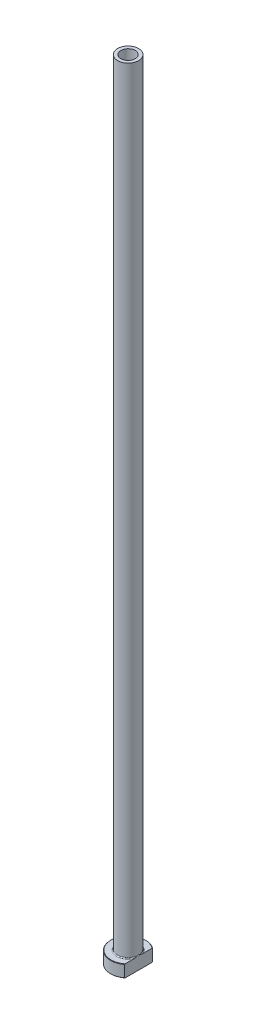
ISO-10303-21;
HEADER;
FILE_DESCRIPTION(('STEP AP214'),'2;1');
FILE_NAME('part.step','',(''),(''),'','','');
FILE_SCHEMA(('AUTOMOTIVE_DESIGN { 1 0 10303 214 1 1 1 1 }'));
ENDSEC;
DATA;
#1=APPLICATION_CONTEXT('core data for automotive mechanical design processes');
#2=APPLICATION_PROTOCOL_DEFINITION('international standard','automotive_design',2000,#1);
#3=PRODUCT_CONTEXT('',#1,'mechanical');
#4=PRODUCT('Part','Part','',(#3));
#5=PRODUCT_RELATED_PRODUCT_CATEGORY('part','',(#4));
#6=PRODUCT_DEFINITION_FORMATION('','',#4);
#7=PRODUCT_DEFINITION_CONTEXT('part definition',#1,'design');
#8=PRODUCT_DEFINITION('design','',#6,#7);
#9=PRODUCT_DEFINITION_SHAPE('','',#8);
#10=(LENGTH_UNIT() NAMED_UNIT(*) SI_UNIT(.MILLI.,.METRE.));
#11=(NAMED_UNIT(*) PLANE_ANGLE_UNIT() SI_UNIT($,.RADIAN.));
#12=(NAMED_UNIT(*) SI_UNIT($,.STERADIAN.) SOLID_ANGLE_UNIT());
#13=UNCERTAINTY_MEASURE_WITH_UNIT(LENGTH_MEASURE(1.E-05),#10,'distance_accuracy_value','');
#14=(GEOMETRIC_REPRESENTATION_CONTEXT(3) GLOBAL_UNCERTAINTY_ASSIGNED_CONTEXT((#13)) GLOBAL_UNIT_ASSIGNED_CONTEXT((#10,
#11,#12)) REPRESENTATION_CONTEXT('',''));
#15=CARTESIAN_POINT('',(0.,0.,0.));
#16=DIRECTION('',(0.,0.,1.));
#17=DIRECTION('',(1.,0.,0.));
#18=AXIS2_PLACEMENT_3D('',#15,#16,#17);
#19=CARTESIAN_POINT('',(0.,92.1876809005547,0.));
#20=DIRECTION('',(0.,1.,0.));
#21=DIRECTION('',(0.,0.,1.));
#22=AXIS2_PLACEMENT_3D('',#19,#20,#21);
#23=CYLINDRICAL_SURFACE('',#22,4.10000000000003);
#24=CARTESIAN_POINT('',(0.,450.,0.));
#25=DIRECTION('',(0.,1.,0.));
#26=DIRECTION('',(0.,0.,1.));
#27=AXIS2_PLACEMENT_3D('',#24,#25,#26);
#28=CIRCLE('',#27,4.10000000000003);
#29=CARTESIAN_POINT('',(0.,450.,4.10000000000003));
#30=VERTEX_POINT('',#29);
#31=EDGE_CURVE('E167',#30,#30,#28,.T.);
#32=ORIENTED_EDGE('',*,*,#31,.T.);
#33=EDGE_LOOP('',(#32));
#34=FACE_BOUND('',#33,.T.);
#35=CARTESIAN_POINT('',(0.,405.,0.));
#36=DIRECTION('',(0.,1.,0.));
#37=DIRECTION('',(0.,0.,1.));
#38=AXIS2_PLACEMENT_3D('',#35,#36,#37);
#39=CIRCLE('',#38,4.10000000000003);
#40=CARTESIAN_POINT('',(0.,405.,4.10000000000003));
#41=VERTEX_POINT('',#40);
#42=EDGE_CURVE('E170',#41,#41,#39,.T.);
#43=ORIENTED_EDGE('',*,*,#42,.F.);
#44=EDGE_LOOP('',(#43));
#45=FACE_BOUND('',#44,.T.);
#46=ADVANCED_FACE('F32',(#34,#45),#23,.F.);
#47=CARTESIAN_POINT('',(-4.10000000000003,450.,0.));
#48=DIRECTION('',(0.,1.,0.));
#49=DIRECTION('',(0.,0.,1.));
#50=AXIS2_PLACEMENT_3D('',#47,#48,#49);
#51=PLANE('',#50);
#52=CARTESIAN_POINT('',(0.,450.,0.));
#53=DIRECTION('',(0.,1.,0.));
#54=DIRECTION('',(0.,0.,1.));
#55=AXIS2_PLACEMENT_3D('',#52,#53,#54);
#56=CIRCLE('',#55,6.00000000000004);
#57=CARTESIAN_POINT('',(0.,450.,6.00000000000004));
#58=VERTEX_POINT('',#57);
#59=EDGE_CURVE('E174',#58,#58,#56,.T.);
#60=ORIENTED_EDGE('',*,*,#59,.T.);
#61=EDGE_LOOP('',(#60));
#62=FACE_BOUND('',#61,.T.);
#63=ORIENTED_EDGE('',*,*,#31,.F.);
#64=EDGE_LOOP('',(#63));
#65=FACE_BOUND('',#64,.T.);
#66=ADVANCED_FACE('F157',(#62,#65),#51,.T.);
#67=CARTESIAN_POINT('',(0.,92.1876809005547,0.));
#68=DIRECTION('',(0.,1.,0.));
#69=DIRECTION('',(0.,0.,1.));
#70=AXIS2_PLACEMENT_3D('',#67,#68,#69);
#71=CYLINDRICAL_SURFACE('',#70,6.00000000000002);
#72=CARTESIAN_POINT('',(0.,7.50000000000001,0.));
#73=DIRECTION('',(0.,1.,0.));
#74=DIRECTION('',(0.,0.,1.));
#75=AXIS2_PLACEMENT_3D('',#72,#73,#74);
#76=CIRCLE('',#75,6.00000000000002);
#77=CARTESIAN_POINT('',(6.00000000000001,7.50000000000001,0.));
#78=VERTEX_POINT('',#77);
#79=EDGE_CURVE('E180',#78,#78,#76,.T.);
#80=ORIENTED_EDGE('',*,*,#79,.T.);
#81=EDGE_LOOP('',(#80));
#82=FACE_BOUND('',#81,.T.);
#83=ORIENTED_EDGE('',*,*,#59,.F.);
#84=EDGE_LOOP('',(#83));
#85=FACE_BOUND('',#84,.T.);
#86=ADVANCED_FACE('F162',(#82,#85),#71,.T.);
#87=CARTESIAN_POINT('',(-5.99999999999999,7.,0.));
#88=DIRECTION('',(0.,1.,0.));
#89=DIRECTION('',(0.,0.,1.));
#90=AXIS2_PLACEMENT_3D('',#87,#88,#89);
#91=PLANE('',#90);
#92=DIRECTION('',(0.,0.,1.));
#93=VECTOR('',#92,1.);
#94=CARTESIAN_POINT('',(6.,7.,0.));
#95=LINE('',#94,#93);
#96=CARTESIAN_POINT('',(6.,7.,-7.74854825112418));
#97=VERTEX_POINT('',#96);
#98=CARTESIAN_POINT('',(6.,7.,-2.50000000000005));
#99=VERTEX_POINT('',#98);
#100=EDGE_CURVE('E54',#97,#99,#95,.T.);
#101=ORIENTED_EDGE('',*,*,#100,.F.);
#102=CARTESIAN_POINT('',(0.,7.,0.));
#103=DIRECTION('',(0.,1.,0.));
#104=DIRECTION('',(0.,0.,1.));
#105=AXIS2_PLACEMENT_3D('',#102,#103,#104);
#106=CIRCLE('',#105,9.79999999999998);
#107=CARTESIAN_POINT('',(5.99999999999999,7.,7.74854825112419));
#108=VERTEX_POINT('',#107);
#109=EDGE_CURVE('E186',#97,#108,#106,.T.);
#110=ORIENTED_EDGE('',*,*,#109,.T.);
#111=CARTESIAN_POINT('',(6.,7.,2.50000000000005));
#112=VERTEX_POINT('',#111);
#113=EDGE_CURVE('E134',#112,#108,#95,.T.);
#114=ORIENTED_EDGE('',*,*,#113,.F.);
#115=CARTESIAN_POINT('',(0.,7.,0.));
#116=DIRECTION('',(0.,1.,0.));
#117=DIRECTION('',(0.,0.,1.));
#118=AXIS2_PLACEMENT_3D('',#115,#116,#117);
#119=CIRCLE('',#118,6.50000000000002);
#120=EDGE_CURVE('E183',#112,#99,#119,.F.);
#121=ORIENTED_EDGE('',*,*,#120,.T.);
#122=EDGE_LOOP('',(#101,#110,#114,#121));
#123=FACE_BOUND('',#122,.T.);
#124=ADVANCED_FACE('F197',(#123),#91,.T.);
#125=CARTESIAN_POINT('',(0.,92.1876809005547,0.));
#126=DIRECTION('',(0.,1.,0.));
#127=DIRECTION('',(0.,0.,1.));
#128=AXIS2_PLACEMENT_3D('',#125,#126,#127);
#129=CYLINDRICAL_SURFACE('',#128,9.99999999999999);
#130=DIRECTION('',(0.,-1.,0.));
#131=VECTOR('',#130,1.);
#132=CARTESIAN_POINT('',(5.99999999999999,450.,7.99999999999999));
#133=LINE('',#132,#131);
#134=CARTESIAN_POINT('',(5.99999999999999,6.79999999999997,7.99999999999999));
#135=VERTEX_POINT('',#134);
#136=CARTESIAN_POINT('',(5.99999999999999,0.200000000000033,7.99999999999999));
#137=VERTEX_POINT('',#136);
#138=EDGE_CURVE('E82',#135,#137,#133,.T.);
#139=ORIENTED_EDGE('',*,*,#138,.F.);
#140=CARTESIAN_POINT('',(0.,6.79999999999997,0.));
#141=DIRECTION('',(0.,1.,0.));
#142=DIRECTION('',(0.,0.,1.));
#143=AXIS2_PLACEMENT_3D('',#140,#141,#142);
#144=CIRCLE('',#143,9.99999999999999);
#145=CARTESIAN_POINT('',(6.,6.79999999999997,-7.99999999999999));
#146=VERTEX_POINT('',#145);
#147=EDGE_CURVE('E95',#135,#146,#144,.F.);
#148=ORIENTED_EDGE('',*,*,#147,.T.);
#149=DIRECTION('',(0.,-1.,0.));
#150=VECTOR('',#149,1.);
#151=CARTESIAN_POINT('',(6.,450.,-7.99999999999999));
#152=LINE('',#151,#150);
#153=CARTESIAN_POINT('',(6.,0.200000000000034,-7.99999999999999));
#154=VERTEX_POINT('',#153);
#155=EDGE_CURVE('E192',#146,#154,#152,.T.);
#156=ORIENTED_EDGE('',*,*,#155,.T.);
#157=CARTESIAN_POINT('',(0.,0.200000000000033,0.));
#158=DIRECTION('',(0.,-1.,0.));
#159=DIRECTION('',(0.,0.,-1.));
#160=AXIS2_PLACEMENT_3D('',#157,#158,#159);
#161=CIRCLE('',#160,9.99999999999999);
#162=EDGE_CURVE('E98',#154,#137,#161,.F.);
#163=ORIENTED_EDGE('',*,*,#162,.T.);
#164=EDGE_LOOP('',(#139,#148,#156,#163));
#165=FACE_BOUND('',#164,.T.);
#166=ADVANCED_FACE('F190',(#165),#129,.T.);
#167=CARTESIAN_POINT('',(-9.99999999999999,0.,0.));
#168=DIRECTION('',(0.,-1.,0.));
#169=DIRECTION('',(0.,0.,-1.));
#170=AXIS2_PLACEMENT_3D('',#167,#168,#169);
#171=PLANE('',#170);
#172=CARTESIAN_POINT('',(0.,0.,0.));
#173=DIRECTION('',(0.,-1.,0.));
#174=DIRECTION('',(0.,0.,-1.));
#175=AXIS2_PLACEMENT_3D('',#172,#173,#174);
#176=CIRCLE('',#175,4.84999999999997);
#177=CARTESIAN_POINT('',(0.,0.,-4.84999999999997));
#178=VERTEX_POINT('',#177);
#179=EDGE_CURVE('E40',#178,#178,#176,.F.);
#180=ORIENTED_EDGE('',*,*,#179,.T.);
#181=EDGE_LOOP('',(#180));
#182=FACE_BOUND('',#181,.T.);
#183=DIRECTION('',(0.,0.,-1.));
#184=VECTOR('',#183,1.);
#185=CARTESIAN_POINT('',(5.99999999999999,0.,7.99999999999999));
#186=LINE('',#185,#184);
#187=CARTESIAN_POINT('',(5.99999999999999,0.,7.74854825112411));
#188=VERTEX_POINT('',#187);
#189=CARTESIAN_POINT('',(6.,0.,-7.74854825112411));
#190=VERTEX_POINT('',#189);
#191=EDGE_CURVE('E47',#188,#190,#186,.T.);
#192=ORIENTED_EDGE('',*,*,#191,.F.);
#193=CARTESIAN_POINT('',(0.,0.,0.));
#194=DIRECTION('',(0.,-1.,0.));
#195=DIRECTION('',(0.,0.,-1.));
#196=AXIS2_PLACEMENT_3D('',#193,#194,#195);
#197=CIRCLE('',#196,9.79999999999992);
#198=EDGE_CURVE('E92',#188,#190,#197,.T.);
#199=ORIENTED_EDGE('',*,*,#198,.T.);
#200=EDGE_LOOP('',(#192,#199));
#201=FACE_BOUND('',#200,.T.);
#202=ADVANCED_FACE('F91',(#182,#201),#171,.T.);
#203=CARTESIAN_POINT('',(0.,92.1876809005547,0.));
#204=DIRECTION('',(0.,1.,0.));
#205=DIRECTION('',(0.,0.,1.));
#206=AXIS2_PLACEMENT_3D('',#203,#204,#205);
#207=CYLINDRICAL_SURFACE('',#206,4.35000000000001);
#208=CARTESIAN_POINT('',(0.,0.499999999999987,0.));
#209=DIRECTION('',(0.,-1.,0.));
#210=DIRECTION('',(0.,0.,-1.));
#211=AXIS2_PLACEMENT_3D('',#208,#209,#210);
#212=CIRCLE('',#211,4.35000000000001);
#213=CARTESIAN_POINT('',(0.,0.499999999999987,-4.35000000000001));
#214=VERTEX_POINT('',#213);
#215=EDGE_CURVE('E11',#214,#214,#212,.T.);
#216=ORIENTED_EDGE('',*,*,#215,.T.);
#217=EDGE_LOOP('',(#216));
#218=FACE_BOUND('',#217,.T.);
#219=CARTESIAN_POINT('',(0.,393.,0.));
#220=DIRECTION('',(0.,1.,0.));
#221=DIRECTION('',(0.,0.,1.));
#222=AXIS2_PLACEMENT_3D('',#219,#220,#221);
#223=CIRCLE('',#222,4.35000000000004);
#224=CARTESIAN_POINT('',(0.,393.,4.35000000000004));
#225=VERTEX_POINT('',#224);
#226=EDGE_CURVE('E172',#225,#225,#223,.T.);
#227=ORIENTED_EDGE('',*,*,#226,.T.);
#228=EDGE_LOOP('',(#227));
#229=FACE_BOUND('',#228,.T.);
#230=ADVANCED_FACE('F215',(#218,#229),#207,.F.);
#231=CARTESIAN_POINT('',(0.,393.,0.));
#232=DIRECTION('',(0.,-1.,0.));
#233=DIRECTION('',(0.,0.,-1.));
#234=AXIS2_PLACEMENT_3D('',#231,#232,#233);
#235=CONICAL_SURFACE('',#234,4.35000000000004,0.0208303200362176);
#236=ORIENTED_EDGE('',*,*,#42,.T.);
#237=EDGE_LOOP('',(#236));
#238=FACE_BOUND('',#237,.T.);
#239=ORIENTED_EDGE('',*,*,#226,.F.);
#240=EDGE_LOOP('',(#239));
#241=FACE_BOUND('',#240,.T.);
#242=ADVANCED_FACE('F111',(#238,#241),#235,.F.);
#243=CARTESIAN_POINT('',(0.,7.50000000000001,0.));
#244=DIRECTION('',(0.,1.,0.));
#245=DIRECTION('',(0.,0.,1.));
#246=AXIS2_PLACEMENT_3D('',#243,#244,#245);
#247=TOROIDAL_SURFACE('',#246,6.50000000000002,0.5);
#248=ORIENTED_EDGE('',*,*,#120,.F.);
#249=CARTESIAN_POINT('',(6.00000000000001,7.50000000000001,0.));
#250=CARTESIAN_POINT('',(6.00000000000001,7.50000080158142,6.7058748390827E-11));
#251=CARTESIAN_POINT('',(6.00000000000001,7.50000160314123,2.62463026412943E-07));
#252=CARTESIAN_POINT('',(6.00000000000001,7.50000311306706,1.01907268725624E-06));
#253=CARTESIAN_POINT('',(6.00000000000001,7.50000381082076,1.52838026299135E-06));
#254=CARTESIAN_POINT('',(6.00000000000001,7.50000523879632,2.74467753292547E-06));
#255=CARTESIAN_POINT('',(6.00000000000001,7.50000595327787,3.47066892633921E-06));
#256=CARTESIAN_POINT('',(6.00000000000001,7.5000072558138,4.9933637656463E-06));
#257=CARTESIAN_POINT('',(6.00000000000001,7.5000078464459,5.78800313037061E-06));
#258=CARTESIAN_POINT('',(6.00000000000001,7.50000997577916,8.79661890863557E-06));
#259=CARTESIAN_POINT('',(6.00000000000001,7.50001139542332,1.10980711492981E-05));
#260=CARTESIAN_POINT('',(6.00000000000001,7.50001378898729,1.57116138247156E-05));
#261=CARTESIAN_POINT('',(6.,7.50001478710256,1.80117483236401E-05));
#262=CARTESIAN_POINT('',(6.,7.50001885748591,2.75423906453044E-05));
#263=CARTESIAN_POINT('',(6.,7.5000218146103,3.48285173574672E-05));
#264=CARTESIAN_POINT('',(6.,7.50002628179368,4.87408506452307E-05));
#265=CARTESIAN_POINT('',(6.,7.50002793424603,5.53214482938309E-05));
#266=CARTESIAN_POINT('',(6.,7.50003978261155,0.000103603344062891));
#267=CARTESIAN_POINT('',(6.,7.50004857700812,0.000145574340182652));
#268=CARTESIAN_POINT('',(5.99999999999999,7.50008704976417,0.000310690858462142));
#269=CARTESIAN_POINT('',(5.99999999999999,7.5001239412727,0.000432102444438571));
#270=CARTESIAN_POINT('',(6.,7.50026686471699,0.000911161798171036));
#271=CARTESIAN_POINT('',(6.,7.50036807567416,0.00126981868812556));
#272=CARTESIAN_POINT('',(5.99999999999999,7.50077195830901,0.00268961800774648));
#273=CARTESIAN_POINT('',(5.99999999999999,7.50108058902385,0.00374948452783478));
#274=CARTESIAN_POINT('',(6.,7.5023632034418,0.00816658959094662));
#275=CARTESIAN_POINT('',(6.,7.50332976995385,0.0115254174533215));
#276=CARTESIAN_POINT('',(5.99999999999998,7.51709820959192,0.0593544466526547));
#277=CARTESIAN_POINT('',(5.99999999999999,7.529954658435,0.103813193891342));
#278=CARTESIAN_POINT('',(6.,7.55506029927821,0.190977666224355));
#279=CARTESIAN_POINT('',(6.,7.56731321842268,0.233682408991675));
#280=CARTESIAN_POINT('',(5.99999999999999,7.59325665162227,0.324512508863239));
#281=CARTESIAN_POINT('',(5.99999999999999,7.6069334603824,0.372641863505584));
#282=CARTESIAN_POINT('',(6.,7.63422038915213,0.469489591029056));
#283=CARTESIAN_POINT('',(6.,7.64782813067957,0.518208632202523));
#284=CARTESIAN_POINT('',(6.,7.68043734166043,0.63633850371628));
#285=CARTESIAN_POINT('',(6.,7.69928754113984,0.705791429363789));
#286=CARTESIAN_POINT('',(6.,7.73566887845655,0.843102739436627));
#287=CARTESIAN_POINT('',(6.,7.75322160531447,0.910955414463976));
#288=CARTESIAN_POINT('',(6.,7.80024878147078,1.09857433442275));
#289=CARTESIAN_POINT('',(6.,7.82864900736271,1.21861610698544));
#290=CARTESIAN_POINT('',(6.,7.88105633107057,1.46081534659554));
#291=CARTESIAN_POINT('',(6.,7.90502088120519,1.58298212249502));
#292=CARTESIAN_POINT('',(6.,7.94810499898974,1.83866408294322));
#293=CARTESIAN_POINT('',(6.,7.96665856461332,1.9722808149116));
#294=CARTESIAN_POINT('',(6.,7.98621697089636,2.17329578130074));
#295=CARTESIAN_POINT('',(6.,7.99135613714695,2.24029152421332));
#296=CARTESIAN_POINT('',(6.,7.99832928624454,2.37444824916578));
#297=CARTESIAN_POINT('',(6.,8.00016429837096,2.44160917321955));
#298=CARTESIAN_POINT('',(6.,7.9998467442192,2.56298631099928));
#299=CARTESIAN_POINT('',(6.,7.99839439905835,2.61720324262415));
#300=CARTESIAN_POINT('',(6.,7.99236557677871,2.72552036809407));
#301=CARTESIAN_POINT('',(6.,7.98778645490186,2.7796204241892));
#302=CARTESIAN_POINT('',(6.,7.9749291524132,2.8866471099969));
#303=CARTESIAN_POINT('',(6.,7.96670262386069,2.93957965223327));
#304=CARTESIAN_POINT('',(6.,7.94570253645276,3.04448333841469));
#305=CARTESIAN_POINT('',(6.,7.93293488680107,3.09645563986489));
#306=CARTESIAN_POINT('',(6.,7.90135968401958,3.19943606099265));
#307=CARTESIAN_POINT('',(6.,7.8824717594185,3.25042120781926));
#308=CARTESIAN_POINT('',(6.,7.84818685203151,3.3240378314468));
#309=CARTESIAN_POINT('',(6.,7.83579052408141,3.34806431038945));
#310=CARTESIAN_POINT('',(6.,7.80866016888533,3.39474488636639));
#311=CARTESIAN_POINT('',(6.,7.79392968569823,3.41740099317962));
#312=CARTESIAN_POINT('',(6.,7.76577135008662,3.4552417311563));
#313=CARTESIAN_POINT('',(6.,7.7529471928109,3.47087266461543));
#314=CARTESIAN_POINT('',(6.,7.72556313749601,3.50058040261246));
#315=CARTESIAN_POINT('',(6.,7.71100204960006,3.51465612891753));
#316=CARTESIAN_POINT('',(6.,7.67984897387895,3.5407700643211));
#317=CARTESIAN_POINT('',(6.,7.66323651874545,3.55278430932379));
#318=CARTESIAN_POINT('',(6.,7.62815222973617,3.57370259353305));
#319=CARTESIAN_POINT('',(6.,7.60968501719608,3.58261412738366));
#320=CARTESIAN_POINT('',(6.,7.5763989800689,3.59454653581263));
#321=CARTESIAN_POINT('',(6.,7.56191673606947,3.59850385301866));
#322=CARTESIAN_POINT('',(6.,7.53249228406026,3.60392336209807));
#323=CARTESIAN_POINT('',(6.,7.51755044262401,3.60538749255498));
#324=CARTESIAN_POINT('',(6.,7.4876183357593,3.60568912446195));
#325=CARTESIAN_POINT('',(6.,7.47262803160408,3.60452285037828));
#326=CARTESIAN_POINT('',(6.,7.44306278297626,3.59966500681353));
#327=CARTESIAN_POINT('',(6.,7.42848812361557,3.59597174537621));
#328=CARTESIAN_POINT('',(6.,7.39702156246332,3.58531109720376));
#329=CARTESIAN_POINT('',(6.,7.38031267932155,3.57780732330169));
#330=CARTESIAN_POINT('',(6.,7.34834450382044,3.56018434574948));
#331=CARTESIAN_POINT('',(6.,7.33308764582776,3.55006085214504));
#332=CARTESIAN_POINT('',(6.,7.29715308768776,3.52252389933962));
#333=CARTESIAN_POINT('',(6.,7.27737832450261,3.50394102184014));
#334=CARTESIAN_POINT('',(6.,7.24088410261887,3.46399503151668));
#335=CARTESIAN_POINT('',(6.,7.22417302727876,3.44262455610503));
#336=CARTESIAN_POINT('',(6.,7.18148338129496,3.38088102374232));
#337=CARTESIAN_POINT('',(6.,7.15831783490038,3.33858120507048));
#338=CARTESIAN_POINT('',(6.,7.11822747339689,3.2512808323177));
#339=CARTESIAN_POINT('',(6.,7.10130560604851,3.20627901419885));
#340=CARTESIAN_POINT('',(6.,7.07193388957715,3.11375892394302));
#341=CARTESIAN_POINT('',(6.,7.05959256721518,3.06620687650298));
#342=CARTESIAN_POINT('',(6.,7.03888782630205,2.97022063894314));
#343=CARTESIAN_POINT('',(6.,7.03052890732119,2.92178551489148));
#344=CARTESIAN_POINT('',(6.,7.01697563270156,2.82374574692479));
#345=CARTESIAN_POINT('',(6.,7.01183067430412,2.77413446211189));
#346=CARTESIAN_POINT('',(6.,7.00435015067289,2.67475263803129));
#347=CARTESIAN_POINT('',(6.,7.00201229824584,2.62498226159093));
#348=CARTESIAN_POINT('',(6.,6.9989719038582,2.49377014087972));
#349=CARTESIAN_POINT('',(6.,7.00025005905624,2.41228296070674));
#350=CARTESIAN_POINT('',(6.,7.00775652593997,2.24952135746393));
#351=CARTESIAN_POINT('',(6.,7.01398784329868,2.16824709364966));
#352=CARTESIAN_POINT('',(6.,7.03045087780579,2.00575531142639));
#353=CARTESIAN_POINT('',(6.,7.04070001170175,1.92453960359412));
#354=CARTESIAN_POINT('',(6.,7.06442774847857,1.76257601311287));
#355=CARTESIAN_POINT('',(6.,7.07790697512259,1.68182822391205));
#356=CARTESIAN_POINT('',(6.,7.11973611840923,1.45394312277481));
#357=CARTESIAN_POINT('',(6.,7.15113840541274,1.30736987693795));
#358=CARTESIAN_POINT('',(6.,7.21927147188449,1.01717316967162));
#359=CARTESIAN_POINT('',(6.,7.25594155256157,0.873534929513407));
#360=CARTESIAN_POINT('',(6.,7.30765759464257,0.680321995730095));
#361=CARTESIAN_POINT('',(6.,7.32124979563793,0.630351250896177));
#362=CARTESIAN_POINT('',(6.,7.34913735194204,0.529103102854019));
#363=CARTESIAN_POINT('',(6.,7.36344174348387,0.477828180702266));
#364=CARTESIAN_POINT('',(6.,7.38809313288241,0.390268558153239));
#365=CARTESIAN_POINT('',(6.,7.39837954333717,0.353966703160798));
#366=CARTESIAN_POINT('',(6.,7.41893445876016,0.281778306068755));
#367=CARTESIAN_POINT('',(5.99999999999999,7.42920197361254,0.245891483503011));
#368=CARTESIAN_POINT('',(6.,7.44864004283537,0.178137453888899));
#369=CARTESIAN_POINT('',(6.,7.45780513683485,0.146268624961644));
#370=CARTESIAN_POINT('',(5.99999999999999,7.47656016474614,0.0812304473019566));
#371=CARTESIAN_POINT('',(5.99999999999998,7.48615204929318,0.0480615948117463));
#372=CARTESIAN_POINT('',(6.,7.4966696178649,0.0115277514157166));
#373=CARTESIAN_POINT('',(6.,7.49763546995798,0.00817123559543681));
#374=CARTESIAN_POINT('',(5.99999999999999,7.49891791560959,0.00375466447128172));
#375=CARTESIAN_POINT('',(5.99999999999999,7.49922706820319,0.00269301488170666));
#376=CARTESIAN_POINT('',(6.,7.49963158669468,0.00127098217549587));
#377=CARTESIAN_POINT('',(6.,7.49973292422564,0.000911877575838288));
#378=CARTESIAN_POINT('',(5.99999999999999,7.49987600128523,0.000432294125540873));
#379=CARTESIAN_POINT('',(5.99999999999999,7.49991291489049,0.000310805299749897));
#380=CARTESIAN_POINT('',(6.,7.49995140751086,0.000145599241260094));
#381=CARTESIAN_POINT('',(6.,7.49996020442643,0.000103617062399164));
#382=CARTESIAN_POINT('',(6.,7.49997205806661,5.53238302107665E-05));
#383=CARTESIAN_POINT('',(6.,7.49997371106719,4.87425785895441E-05));
#384=CARTESIAN_POINT('',(6.,7.49997817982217,3.48289334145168E-05));
#385=CARTESIAN_POINT('',(6.,7.49998113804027,2.75421830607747E-05));
#386=CARTESIAN_POINT('',(6.,7.49998520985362,1.80109041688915E-05));
#387=CARTESIAN_POINT('',(6.00000000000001,7.49998620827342,1.57107205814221E-05));
#388=CARTESIAN_POINT('',(6.00000000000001,7.49998860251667,1.10971326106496E-05));
#389=CARTESIAN_POINT('',(6.00000000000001,7.49999002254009,8.79568968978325E-06));
#390=CARTESIAN_POINT('',(6.00000000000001,7.49999215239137,5.78714885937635E-06));
#391=CARTESIAN_POINT('',(6.00000000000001,7.49999274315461,4.99254543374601E-06));
#392=CARTESIAN_POINT('',(6.00000000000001,7.49999404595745,3.46994613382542E-06));
#393=CARTESIAN_POINT('',(6.00000000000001,7.49999476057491,2.74401500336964E-06));
#394=CARTESIAN_POINT('',(6.00000000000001,7.49999618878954,1.52786073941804E-06));
#395=CARTESIAN_POINT('',(6.00000000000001,7.49999688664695,1.01863109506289E-06));
#396=CARTESIAN_POINT('',(6.00000000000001,7.4999983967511,2.62215886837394E-07));
#397=CARTESIAN_POINT('',(6.00000000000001,7.49999919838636,-6.70601439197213E-11));
#398=CARTESIAN_POINT('',(6.00000000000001,7.50000000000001,0.));
#399=B_SPLINE_CURVE_WITH_KNOTS('',3,(#249,#250,#251,#252,#253,#254,#255,#256,#257,#258,#259,
#260,#261,#262,#263,#264,#265,#266,#267,#268,#269,#270,#271,#272,#273,#274,#275,#276,#277,#278,
#279,#280,#281,#282,#283,#284,#285,#286,#287,#288,#289,#290,#291,#292,#293,#294,#295,#296,#297,
#298,#299,#300,#301,#302,#303,#304,#305,#306,#307,#308,#309,#310,#311,#312,#313,#314,#315,#316,
#317,#318,#319,#320,#321,#322,#323,#324,#325,#326,#327,#328,#329,#330,#331,#332,#333,#334,#335,
#336,#337,#338,#339,#340,#341,#342,#343,#344,#345,#346,#347,#348,#349,#350,#351,#352,#353,#354,
#355,#356,#357,#358,#359,#360,#361,#362,#363,#364,#365,#366,#367,#368,#369,#370,#371,#372,#373,
#374,#375,#376,#377,#378,#379,#380,#381,#382,#383,#384,#385,#386,#387,#388,#389,#390,#391,#392,
#393,#394,#395,#396,#397,#398),.UNSPECIFIED.,.T.,.F.,(4,2,2,2,2,2,2,2,2,2,2,2,2,2,2,2,2,2,2,2,2,
2,2,2,2,2,2,2,2,2,2,2,2,2,2,2,2,2,2,2,2,2,2,2,2,2,2,2,2,2,2,2,2,2,2,2,2,2,2,2,2,2,2,2,2,2,2,2,2,
2,2,2,2,2,4),(0.,2.41532518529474E-06,5.00161177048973E-06,8.04115165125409E-06,
1.10092212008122E-05,1.90889624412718E-05,2.66047225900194E-05,5.01453938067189E-05,
7.04739841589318E-05,0.000199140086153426,0.000579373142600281,0.001697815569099,
0.00500893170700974,0.0154949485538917,0.154330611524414,0.287615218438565,0.437719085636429,
0.58947001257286,0.805361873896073,1.01561737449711,1.38561400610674,1.75899405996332,
2.16331287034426,2.36482907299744,2.5662824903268,2.72891861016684,2.89169246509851,
3.05223140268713,3.21256219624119,3.37509011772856,3.45609970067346,3.53698744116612,
3.59753760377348,3.65812948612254,3.71938396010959,3.78048942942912,3.82533702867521,
3.87014974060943,3.91502681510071,3.95993396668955,4.01458097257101,4.06931803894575,
4.15026803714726,4.23143634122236,4.37530581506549,4.51924312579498,4.66640085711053,
4.81372446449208,4.96325999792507,5.112673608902,5.35695170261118,5.60137814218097,
5.84687607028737,6.09242144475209,6.54191534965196,6.9865930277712,7.14195169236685,
7.3016489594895,7.41484221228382,7.52682205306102,7.62630458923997,7.72988447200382,
7.74036324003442,7.74367992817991,7.7447997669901,7.74518024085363,7.7453089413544,
7.74532927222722,7.74535281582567,7.74536033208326,7.7453684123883,7.74537138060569,
7.74537442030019,7.74537700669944,7.74537942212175),.UNSPECIFIED.);
#400=EDGE_CURVE('E126',#112,#78,#399,.T.);
#401=ORIENTED_EDGE('',*,*,#400,.T.);
#402=ORIENTED_EDGE('',*,*,#79,.F.);
#403=CARTESIAN_POINT('',(6.00000000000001,7.50000000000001,0.));
#404=CARTESIAN_POINT('',(6.00000000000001,7.49999919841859,-6.70577002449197E-11));
#405=CARTESIAN_POINT('',(6.00000000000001,7.49999839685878,-2.62463025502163E-07));
#406=CARTESIAN_POINT('',(6.00000000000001,7.49999688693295,-1.01907268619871E-06));
#407=CARTESIAN_POINT('',(6.00000000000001,7.49999618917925,-1.52838026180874E-06));
#408=CARTESIAN_POINT('',(6.00000000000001,7.4999947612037,-2.74467753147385E-06));
#409=CARTESIAN_POINT('',(6.00000000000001,7.49999404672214,-3.47066892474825E-06));
#410=CARTESIAN_POINT('',(6.00000000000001,7.49999274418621,-4.99336376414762E-06));
#411=CARTESIAN_POINT('',(6.00000000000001,7.49999215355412,-5.78800312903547E-06));
#412=CARTESIAN_POINT('',(6.00000000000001,7.49999002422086,-8.79661890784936E-06));
#413=CARTESIAN_POINT('',(6.00000000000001,7.49998860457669,-1.10980711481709E-05));
#414=CARTESIAN_POINT('',(6.00000000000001,7.49998621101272,-1.57116138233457E-05));
#415=CARTESIAN_POINT('',(6.,7.49998521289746,-1.80117483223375E-05));
#416=CARTESIAN_POINT('',(6.,7.4999811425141,-2.75423906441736E-05));
#417=CARTESIAN_POINT('',(6.,7.49997818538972,-3.48285173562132E-05));
#418=CARTESIAN_POINT('',(6.,7.49997371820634,-4.87408506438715E-05));
#419=CARTESIAN_POINT('',(6.,7.49997206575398,-5.53214482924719E-05));
#420=CARTESIAN_POINT('',(6.,7.49996021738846,-0.000103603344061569));
#421=CARTESIAN_POINT('',(6.,7.4999514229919,-0.000145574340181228));
#422=CARTESIAN_POINT('',(5.99999999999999,7.49991295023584,-0.0003106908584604));
#423=CARTESIAN_POINT('',(5.99999999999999,7.49987605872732,-0.000432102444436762));
#424=CARTESIAN_POINT('',(6.,7.49973313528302,-0.000911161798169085));
#425=CARTESIAN_POINT('',(6.,7.49963192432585,-0.00126981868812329));
#426=CARTESIAN_POINT('',(5.99999999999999,7.499228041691,-0.00268961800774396));
#427=CARTESIAN_POINT('',(5.99999999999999,7.49891941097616,-0.00374948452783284));
#428=CARTESIAN_POINT('',(6.,7.49763679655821,-0.00816658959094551));
#429=CARTESIAN_POINT('',(6.,7.49667023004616,-0.0115254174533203));
#430=CARTESIAN_POINT('',(5.99999999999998,7.48290179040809,-0.0593544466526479));
#431=CARTESIAN_POINT('',(5.99999999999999,7.47004534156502,-0.103813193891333));
#432=CARTESIAN_POINT('',(6.,7.44493970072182,-0.190977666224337));
#433=CARTESIAN_POINT('',(6.,7.43268678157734,-0.23368240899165));
#434=CARTESIAN_POINT('',(5.99999999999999,7.40674334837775,-0.324512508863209));
#435=CARTESIAN_POINT('',(5.99999999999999,7.39306653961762,-0.372641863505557));
#436=CARTESIAN_POINT('',(6.,7.36577961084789,-0.469489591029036));
#437=CARTESIAN_POINT('',(6.,7.35217186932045,-0.518208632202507));
#438=CARTESIAN_POINT('',(6.,7.31956265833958,-0.636338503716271));
#439=CARTESIAN_POINT('',(6.,7.30071245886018,-0.705791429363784));
#440=CARTESIAN_POINT('',(6.,7.26433112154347,-0.843102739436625));
#441=CARTESIAN_POINT('',(6.,7.24677839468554,-0.910955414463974));
#442=CARTESIAN_POINT('',(6.,7.19975121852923,-1.09857433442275));
#443=CARTESIAN_POINT('',(6.,7.1713509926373,-1.21861610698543));
#444=CARTESIAN_POINT('',(6.,7.11894366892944,-1.46081534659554));
#445=CARTESIAN_POINT('',(6.,7.09497911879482,-1.58298212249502));
#446=CARTESIAN_POINT('',(6.,7.05189500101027,-1.83866408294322));
#447=CARTESIAN_POINT('',(6.,7.03334143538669,-1.97228081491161));
#448=CARTESIAN_POINT('',(6.,7.01378302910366,-2.17329578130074));
#449=CARTESIAN_POINT('',(6.,7.00864386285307,-2.24029152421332));
#450=CARTESIAN_POINT('',(6.,7.00167071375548,-2.37444824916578));
#451=CARTESIAN_POINT('',(6.,6.99983570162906,-2.44160917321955));
#452=CARTESIAN_POINT('',(6.,7.00015325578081,-2.56298631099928));
#453=CARTESIAN_POINT('',(6.,7.00160560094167,-2.61720324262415));
#454=CARTESIAN_POINT('',(6.,7.0076344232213,-2.72552036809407));
#455=CARTESIAN_POINT('',(6.,7.01221354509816,-2.7796204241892));
#456=CARTESIAN_POINT('',(6.,7.02507084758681,-2.8866471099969));
#457=CARTESIAN_POINT('',(6.,7.03329737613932,-2.93957965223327));
#458=CARTESIAN_POINT('',(6.,7.05429746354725,-3.04448333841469));
#459=CARTESIAN_POINT('',(6.,7.06706511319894,-3.09645563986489));
#460=CARTESIAN_POINT('',(6.,7.09864031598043,-3.19943606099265));
#461=CARTESIAN_POINT('',(6.,7.11752824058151,-3.25042120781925));
#462=CARTESIAN_POINT('',(6.,7.1518131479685,-3.32403783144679));
#463=CARTESIAN_POINT('',(6.,7.16420947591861,-3.34806431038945));
#464=CARTESIAN_POINT('',(6.,7.19133983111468,-3.39474488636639));
#465=CARTESIAN_POINT('',(6.,7.20607031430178,-3.41740099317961));
#466=CARTESIAN_POINT('',(6.,7.23422864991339,-3.45524173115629));
#467=CARTESIAN_POINT('',(6.,7.24705280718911,-3.47087266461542));
#468=CARTESIAN_POINT('',(6.,7.274436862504,-3.50058040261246));
#469=CARTESIAN_POINT('',(6.,7.28899795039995,-3.51465612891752));
#470=CARTESIAN_POINT('',(6.,7.32015102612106,-3.54077006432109));
#471=CARTESIAN_POINT('',(6.,7.33676348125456,-3.55278430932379));
#472=CARTESIAN_POINT('',(6.,7.37184777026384,-3.57370259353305));
#473=CARTESIAN_POINT('',(6.,7.39031498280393,-3.58261412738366));
#474=CARTESIAN_POINT('',(6.,7.42360101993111,-3.59454653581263));
#475=CARTESIAN_POINT('',(6.,7.43808326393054,-3.59850385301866));
#476=CARTESIAN_POINT('',(6.,7.46750771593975,-3.60392336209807));
#477=CARTESIAN_POINT('',(6.,7.482449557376,-3.60538749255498));
#478=CARTESIAN_POINT('',(6.,7.51238166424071,-3.60568912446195));
#479=CARTESIAN_POINT('',(6.,7.52737196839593,-3.60452285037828));
#480=CARTESIAN_POINT('',(6.,7.55693721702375,-3.59966500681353));
#481=CARTESIAN_POINT('',(6.,7.57151187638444,-3.59597174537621));
#482=CARTESIAN_POINT('',(6.,7.6029784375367,-3.58531109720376));
#483=CARTESIAN_POINT('',(6.,7.61968732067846,-3.57780732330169));
#484=CARTESIAN_POINT('',(6.,7.65165549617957,-3.56018434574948));
#485=CARTESIAN_POINT('',(6.,7.66691235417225,-3.55006085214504));
#486=CARTESIAN_POINT('',(6.,7.70284691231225,-3.52252389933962));
#487=CARTESIAN_POINT('',(6.,7.7226216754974,-3.50394102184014));
#488=CARTESIAN_POINT('',(6.,7.75911589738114,-3.46399503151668));
#489=CARTESIAN_POINT('',(6.,7.77582697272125,-3.44262455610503));
#490=CARTESIAN_POINT('',(6.,7.81851661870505,-3.38088102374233));
#491=CARTESIAN_POINT('',(6.,7.84168216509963,-3.33858120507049));
#492=CARTESIAN_POINT('',(6.,7.88177252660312,-3.25128083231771));
#493=CARTESIAN_POINT('',(6.,7.8986943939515,-3.20627901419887));
#494=CARTESIAN_POINT('',(6.,7.92806611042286,-3.11375892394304));
#495=CARTESIAN_POINT('',(6.,7.94040743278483,-3.06620687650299));
#496=CARTESIAN_POINT('',(6.,7.96111217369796,-2.97022063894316));
#497=CARTESIAN_POINT('',(6.,7.96947109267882,-2.9217855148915));
#498=CARTESIAN_POINT('',(6.,7.98302436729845,-2.82374574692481));
#499=CARTESIAN_POINT('',(6.,7.98816932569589,-2.77413446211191));
#500=CARTESIAN_POINT('',(6.,7.99564984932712,-2.67475263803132));
#501=CARTESIAN_POINT('',(6.,7.99798770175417,-2.62498226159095));
#502=CARTESIAN_POINT('',(6.,8.00102809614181,-2.49377014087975));
#503=CARTESIAN_POINT('',(6.,7.99974994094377,-2.41228296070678));
#504=CARTESIAN_POINT('',(6.,7.99224347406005,-2.24952135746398));
#505=CARTESIAN_POINT('',(6.,7.98601215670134,-2.16824709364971));
#506=CARTESIAN_POINT('',(6.,7.96954912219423,-2.00575531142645));
#507=CARTESIAN_POINT('',(6.,7.95929998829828,-1.92453960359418));
#508=CARTESIAN_POINT('',(6.,7.93557225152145,-1.76257601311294));
#509=CARTESIAN_POINT('',(6.,7.92209302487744,-1.68182822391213));
#510=CARTESIAN_POINT('',(6.,7.8802638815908,-1.45394312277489));
#511=CARTESIAN_POINT('',(6.,7.84886159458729,-1.30736987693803));
#512=CARTESIAN_POINT('',(6.,7.78072852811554,-1.0171731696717));
#513=CARTESIAN_POINT('',(6.,7.74405844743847,-0.873534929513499));
#514=CARTESIAN_POINT('',(6.,7.69234240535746,-0.680321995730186));
#515=CARTESIAN_POINT('',(6.,7.6787502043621,-0.630351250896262));
#516=CARTESIAN_POINT('',(6.,7.65086264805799,-0.529103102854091));
#517=CARTESIAN_POINT('',(6.,7.63655825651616,-0.477828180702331));
#518=CARTESIAN_POINT('',(6.,7.61190686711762,-0.390268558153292));
#519=CARTESIAN_POINT('',(6.,7.60162045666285,-0.353966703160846));
#520=CARTESIAN_POINT('',(6.,7.58106554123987,-0.281778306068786));
#521=CARTESIAN_POINT('',(5.99999999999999,7.57079802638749,-0.245891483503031));
#522=CARTESIAN_POINT('',(6.,7.55135995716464,-0.178137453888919));
#523=CARTESIAN_POINT('',(6.,7.54219486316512,-0.146268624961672));
#524=CARTESIAN_POINT('',(5.99999999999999,7.52343983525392,-0.0812304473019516));
#525=CARTESIAN_POINT('',(5.99999999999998,7.513847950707,-0.0480615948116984));
#526=CARTESIAN_POINT('',(6.,7.5033303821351,-0.0115277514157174));
#527=CARTESIAN_POINT('',(6.,7.502364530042,-0.00817123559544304));
#528=CARTESIAN_POINT('',(5.99999999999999,7.50108208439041,-0.00375466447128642));
#529=CARTESIAN_POINT('',(5.99999999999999,7.50077293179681,-0.00269301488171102));
#530=CARTESIAN_POINT('',(6.,7.50036841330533,-0.00127098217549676));
#531=CARTESIAN_POINT('',(6.,7.50026707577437,-0.000911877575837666));
#532=CARTESIAN_POINT('',(5.99999999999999,7.50012399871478,-0.000432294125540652));
#533=CARTESIAN_POINT('',(5.99999999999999,7.50008708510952,-0.000310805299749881));
#534=CARTESIAN_POINT('',(6.,7.50004859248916,-0.000145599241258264));
#535=CARTESIAN_POINT('',(6.,7.50003979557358,-0.000103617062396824));
#536=CARTESIAN_POINT('',(6.,7.50002794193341,-5.53238302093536E-05));
#537=CARTESIAN_POINT('',(6.,7.50002628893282,-4.87425785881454E-05));
#538=CARTESIAN_POINT('',(6.,7.50002182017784,-3.48289334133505E-05));
#539=CARTESIAN_POINT('',(6.,7.50001886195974,-2.75421830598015E-05));
#540=CARTESIAN_POINT('',(6.,7.50001479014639,-1.80109041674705E-05));
#541=CARTESIAN_POINT('',(6.00000000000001,7.50001379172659,-1.57107205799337E-05));
#542=CARTESIAN_POINT('',(6.00000000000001,7.50001139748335,-1.10971326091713E-05));
#543=CARTESIAN_POINT('',(6.00000000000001,7.50000997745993,-8.79568968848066E-06));
#544=CARTESIAN_POINT('',(6.00000000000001,7.50000784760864,-5.78714885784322E-06));
#545=CARTESIAN_POINT('',(6.00000000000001,7.5000072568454,-4.99254543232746E-06));
#546=CARTESIAN_POINT('',(6.00000000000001,7.50000595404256,-3.46994613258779E-06));
#547=CARTESIAN_POINT('',(6.00000000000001,7.5000052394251,-2.7440150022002E-06));
#548=CARTESIAN_POINT('',(6.00000000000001,7.50000381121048,-1.52786073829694E-06));
#549=CARTESIAN_POINT('',(6.00000000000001,7.50000311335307,-1.01863109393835E-06));
#550=CARTESIAN_POINT('',(6.00000000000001,7.50000160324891,-2.62215885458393E-07));
#551=CARTESIAN_POINT('',(6.00000000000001,7.50000080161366,6.70616979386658E-11));
#552=CARTESIAN_POINT('',(6.00000000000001,7.50000000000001,0.));
#553=B_SPLINE_CURVE_WITH_KNOTS('',3,(#403,#404,#405,#406,#407,#408,#409,#410,#411,#412,#413,
#414,#415,#416,#417,#418,#419,#420,#421,#422,#423,#424,#425,#426,#427,#428,#429,#430,#431,#432,
#433,#434,#435,#436,#437,#438,#439,#440,#441,#442,#443,#444,#445,#446,#447,#448,#449,#450,#451,
#452,#453,#454,#455,#456,#457,#458,#459,#460,#461,#462,#463,#464,#465,#466,#467,#468,#469,#470,
#471,#472,#473,#474,#475,#476,#477,#478,#479,#480,#481,#482,#483,#484,#485,#486,#487,#488,#489,
#490,#491,#492,#493,#494,#495,#496,#497,#498,#499,#500,#501,#502,#503,#504,#505,#506,#507,#508,
#509,#510,#511,#512,#513,#514,#515,#516,#517,#518,#519,#520,#521,#522,#523,#524,#525,#526,#527,
#528,#529,#530,#531,#532,#533,#534,#535,#536,#537,#538,#539,#540,#541,#542,#543,#544,#545,#546,
#547,#548,#549,#550,#551,#552),.UNSPECIFIED.,.T.,.F.,(4,2,2,2,2,2,2,2,2,2,2,2,2,2,2,2,2,2,2,2,2,
2,2,2,2,2,2,2,2,2,2,2,2,2,2,2,2,2,2,2,2,2,2,2,2,2,2,2,2,2,2,2,2,2,2,2,2,2,2,2,2,2,2,2,2,2,2,2,2,
2,2,2,2,2,4),(0.,2.41532518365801E-06,5.00161176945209E-06,8.04115165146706E-06,
1.10092212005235E-05,1.90889624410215E-05,2.66047225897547E-05,5.01453938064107E-05,
7.04739841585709E-05,0.000199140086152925,0.000579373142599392,0.00169781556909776,
0.00500893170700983,0.0154949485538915,0.1543306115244,0.287615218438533,0.437719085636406,
0.589470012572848,0.805361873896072,1.01561737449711,1.38561400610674,1.75899405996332,
2.16331287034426,2.36482907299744,2.5662824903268,2.72891861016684,2.8916924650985,
3.05223140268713,3.21256219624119,3.37509011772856,3.45609970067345,3.53698744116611,
3.59753760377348,3.65812948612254,3.71938396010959,3.78048942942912,3.82533702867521,
3.87014974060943,3.91502681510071,3.95993396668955,4.01458097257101,4.06931803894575,
4.15026803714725,4.23143634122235,4.37530581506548,4.51924312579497,4.66640085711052,
4.81372446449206,4.96325999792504,5.11267360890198,5.35695170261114,5.60137814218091,
5.8468760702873,6.09242144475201,6.54191534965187,6.9865930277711,7.14195169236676,
7.30164895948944,7.41484221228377,7.52682205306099,7.62630458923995,7.72988447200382,
7.74036324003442,7.74367992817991,7.7447997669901,7.74518024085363,7.7453089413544,
7.74532927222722,7.74535281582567,7.74536033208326,7.7453684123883,7.74537138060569,
7.74537442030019,7.74537700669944,7.74537942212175),.UNSPECIFIED.);
#554=EDGE_CURVE('E135',#78,#99,#553,.T.);
#555=ORIENTED_EDGE('',*,*,#554,.T.);
#556=EDGE_LOOP('',(#248,#401,#402,#555));
#557=FACE_BOUND('',#556,.T.);
#558=ADVANCED_FACE('F141',(#557),#247,.F.);
#559=CARTESIAN_POINT('',(0.,7.00000000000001,0.));
#560=DIRECTION('',(0.,-1.,0.));
#561=DIRECTION('',(0.,0.,-1.));
#562=AXIS2_PLACEMENT_3D('',#559,#560,#561);
#563=CONICAL_SURFACE('',#562,9.79999999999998,0.785398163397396);
#564=CARTESIAN_POINT('',(6.,-1.79552203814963,-17.6009499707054));
#565=CARTESIAN_POINT('',(6.,-1.52401937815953,-17.3141017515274));
#566=CARTESIAN_POINT('',(6.,-1.25287676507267,-17.0269132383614));
#567=CARTESIAN_POINT('',(6.,-0.711434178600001,-16.4517398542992));
#568=CARTESIAN_POINT('',(6.,-0.441134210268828,-16.1637549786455));
#569=CARTESIAN_POINT('',(6.,0.368940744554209,-15.297766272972));
#570=CARTESIAN_POINT('',(6.,0.907258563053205,-14.7183951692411));
#571=CARTESIAN_POINT('',(6.,1.72215780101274,-13.8331216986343));
#572=CARTESIAN_POINT('',(6.,2.00071138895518,-13.5290344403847));
#573=CARTESIAN_POINT('',(6.,2.5560307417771,-12.9192325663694));
#574=CARTESIAN_POINT('',(6.,2.83279651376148,-12.6135179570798));
#575=CARTESIAN_POINT('',(6.,3.38385174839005,-12.0004608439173));
#576=CARTESIAN_POINT('',(6.,3.65814356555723,-11.6931204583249));
#577=CARTESIAN_POINT('',(6.,4.20403297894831,-11.0760595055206));
#578=CARTESIAN_POINT('',(6.,4.47563060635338,-10.766338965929));
#579=CARTESIAN_POINT('',(6.,5.01505245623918,-10.1444038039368));
#580=CARTESIAN_POINT('',(6.,5.28288153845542,-9.83219340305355));
#581=CARTESIAN_POINT('',(6.,5.814229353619,-9.2040882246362));
#582=CARTESIAN_POINT('',(6.,6.07774785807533,-8.88819325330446));
#583=CARTESIAN_POINT('',(6.,6.60003626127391,-8.2506257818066));
#584=CARTESIAN_POINT('',(6.,6.8587861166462,-7.92893682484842));
#585=CARTESIAN_POINT('',(6.,7.36859509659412,-7.27955943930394));
#586=CARTESIAN_POINT('',(6.,7.61965542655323,-6.95187196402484));
#587=CARTESIAN_POINT('',(6.,7.98576066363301,-6.45775713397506));
#588=CARTESIAN_POINT('',(6.,8.1048617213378,-6.29433436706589));
#589=CARTESIAN_POINT('',(6.,8.34000134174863,-5.96530360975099));
#590=CARTESIAN_POINT('',(6.,8.45604001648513,-5.79969569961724));
#591=CARTESIAN_POINT('',(6.,8.68455547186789,-5.46582678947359));
#592=CARTESIAN_POINT('',(6.,8.79702913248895,-5.29756364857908));
#593=CARTESIAN_POINT('',(6.,9.01753757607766,-4.95816178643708));
#594=CARTESIAN_POINT('',(6.,9.1255726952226,-4.78702328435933));
#595=CARTESIAN_POINT('',(6.,9.33560820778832,-4.44248614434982));
#596=CARTESIAN_POINT('',(6.,9.43764111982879,-4.26910741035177));
#597=CARTESIAN_POINT('',(6.,9.6351809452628,-3.91862113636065));
#598=CARTESIAN_POINT('',(6.,9.7306870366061,-3.74151313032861));
#599=CARTESIAN_POINT('',(6.,9.91348788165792,-3.38344678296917));
#600=CARTESIAN_POINT('',(6.,10.0007956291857,-3.20249511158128));
#601=CARTESIAN_POINT('',(6.,10.165467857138,-2.83615347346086));
#602=CARTESIAN_POINT('',(6.,10.2428364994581,-2.65076540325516));
#603=CARTESIAN_POINT('',(6.,10.3476493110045,-2.37476230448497));
#604=CARTESIAN_POINT('',(6.,10.3798377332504,-2.28593872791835));
#605=CARTESIAN_POINT('',(6.,10.4412613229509,-2.10727300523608));
#606=CARTESIAN_POINT('',(6.,10.4704963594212,-2.01743081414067));
#607=CARTESIAN_POINT('',(6.,10.5533861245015,-1.74635894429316));
#608=CARTESIAN_POINT('',(6.,10.602214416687,-1.56361273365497));
#609=CARTESIAN_POINT('',(6.,10.6846214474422,-1.19573724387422));
#610=CARTESIAN_POINT('',(6.,10.7182826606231,-1.01062662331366));
#611=CARTESIAN_POINT('',(6.,10.768981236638,-0.638123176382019));
#612=CARTESIAN_POINT('',(6.,10.786020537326,-0.450730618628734));
#613=CARTESIAN_POINT('',(6.,10.8025183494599,-0.0738640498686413));
#614=CARTESIAN_POINT('',(6.,10.8018548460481,0.115615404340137));
#615=CARTESIAN_POINT('',(6.,10.7826880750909,0.493653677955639));
#616=CARTESIAN_POINT('',(6.,10.7641846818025,0.682212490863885));
#617=CARTESIAN_POINT('',(6.,10.7103251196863,1.05776266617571));
#618=CARTESIAN_POINT('',(6.,10.6748911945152,1.24474270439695));
#619=CARTESIAN_POINT('',(6.,10.5890121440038,1.61520150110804));
#620=CARTESIAN_POINT('',(6.,10.5385638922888,1.79867952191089));
#621=CARTESIAN_POINT('',(6.,10.3911282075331,2.26914112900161));
#622=CARTESIAN_POINT('',(6.,10.2842782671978,2.55302531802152));
#623=CARTESIAN_POINT('',(6.,10.0463958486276,3.11045503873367));
#624=CARTESIAN_POINT('',(6.,9.91534345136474,3.38399182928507));
#625=CARTESIAN_POINT('',(6.,9.70492342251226,3.78859721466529));
#626=CARTESIAN_POINT('',(5.99999999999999,9.63209854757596,3.92313856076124));
#627=CARTESIAN_POINT('',(5.99999999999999,9.48259417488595,4.19006838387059));
#628=CARTESIAN_POINT('',(5.99999999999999,9.40591462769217,4.32245683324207));
#629=CARTESIAN_POINT('',(5.99999999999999,9.24930540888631,4.58520549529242));
#630=CARTESIAN_POINT('',(5.99999999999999,9.1693772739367,4.71556662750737));
#631=CARTESIAN_POINT('',(5.99999999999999,9.0066978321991,4.97450350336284));
#632=CARTESIAN_POINT('',(5.99999999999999,8.92394663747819,5.10307931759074));
#633=CARTESIAN_POINT('',(5.99999999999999,8.64351229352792,5.52985219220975));
#634=CARTESIAN_POINT('',(5.99999999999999,8.44039926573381,5.82448590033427));
#635=CARTESIAN_POINT('',(5.99999999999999,8.02460715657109,6.40694921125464));
#636=CARTESIAN_POINT('',(5.99999999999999,7.81192597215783,6.69477729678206));
#637=CARTESIAN_POINT('',(5.99999999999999,7.37931497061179,7.26525171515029));
#638=CARTESIAN_POINT('',(5.99999999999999,7.15937990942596,7.54789405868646));
#639=CARTESIAN_POINT('',(5.99999999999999,6.7141394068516,8.10886295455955));
#640=CARTESIAN_POINT('',(5.99999999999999,6.48883440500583,8.38718985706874));
#641=CARTESIAN_POINT('',(5.99999999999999,6.03331036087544,8.94128328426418));
#642=CARTESIAN_POINT('',(5.99999999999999,5.80307787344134,9.21703873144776));
#643=CARTESIAN_POINT('',(5.99999999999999,5.33927970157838,9.76573512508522));
#644=CARTESIAN_POINT('',(5.99999999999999,5.10571395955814,10.0386760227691));
#645=CARTESIAN_POINT('',(5.99999999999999,4.63600560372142,10.5821276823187));
#646=CARTESIAN_POINT('',(5.99999999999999,4.39986411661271,10.8526394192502));
#647=CARTESIAN_POINT('',(5.99999999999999,3.92539621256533,11.3917411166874));
#648=CARTESIAN_POINT('',(5.99999999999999,3.6870697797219,11.6603310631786));
#649=CARTESIAN_POINT('',(5.99999999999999,3.01761185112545,12.4097238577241));
#650=CARTESIAN_POINT('',(5.99999999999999,2.58447471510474,12.8887346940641));
#651=CARTESIAN_POINT('',(5.99999999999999,1.71393239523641,13.8429570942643));
#652=CARTESIAN_POINT('',(5.99999999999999,1.27652670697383,14.3181681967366));
#653=CARTESIAN_POINT('',(5.99999999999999,0.401335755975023,15.2626172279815));
#654=CARTESIAN_POINT('',(5.99999999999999,-0.0364292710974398,15.7318739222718));
#655=CARTESIAN_POINT('',(5.99999999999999,-0.694863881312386,16.4340144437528));
#656=CARTESIAN_POINT('',(5.99999999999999,-0.914623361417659,16.6677530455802));
#657=CARTESIAN_POINT('',(5.99999999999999,-1.35468319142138,17.1347195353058));
#658=CARTESIAN_POINT('',(5.99999999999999,-1.57498354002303,17.3679474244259));
#659=CARTESIAN_POINT('',(5.99999999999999,-1.79552203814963,17.6009499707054));
#660=B_SPLINE_CURVE_WITH_KNOTS('',3,(#564,#565,#566,#567,#568,#569,#570,#571,#572,#573,#574,
#575,#576,#577,#578,#579,#580,#581,#582,#583,#584,#585,#586,#587,#588,#589,#590,#591,#592,#593,
#594,#595,#596,#597,#598,#599,#600,#601,#602,#603,#604,#605,#606,#607,#608,#609,#610,#611,#612,
#613,#614,#615,#616,#617,#618,#619,#620,#621,#622,#623,#624,#625,#626,#627,#628,#629,#630,#631,
#632,#633,#634,#635,#636,#637,#638,#639,#640,#641,#642,#643,#644,#645,#646,#647,#648,#649,#650,
#651,#652,#653,#654,#655,#656,#657,#658,#659),.UNSPECIFIED.,.F.,.F.,(4,2,2,2,2,2,2,2,2,2,2,2,2,
2,2,2,2,2,2,2,2,2,2,2,2,2,2,2,2,2,2,2,2,2,2,2,2,2,2,2,2,2,2,2,2,2,2,4),(0.,1.18488703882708,
2.36978117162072,4.74232601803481,5.97947486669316,7.2166187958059,8.45242468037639,
9.6882162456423,10.9222327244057,12.15631440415,13.3947518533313,14.6329941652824,
15.239620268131,15.8462241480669,16.4533450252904,17.0604198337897,17.6638266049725,
18.2673092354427,18.869818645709,19.4720749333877,19.7554574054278,20.038852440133,
20.6057348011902,21.1694962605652,21.7331919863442,22.3007739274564,22.8683598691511,
23.4385779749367,24.0089148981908,24.9172532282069,25.8263424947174,26.2852509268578,
26.7441652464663,27.2028649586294,27.6615464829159,28.7348221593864,29.808334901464,
30.8826415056,31.9568604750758,33.0345254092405,34.1122089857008,35.1894386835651,
36.2666762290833,38.204040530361,40.1416366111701,42.0668676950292,43.0293387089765,
43.9918074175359),.UNSPECIFIED.);
#661=EDGE_CURVE('E133',#146,#97,#660,.T.);
#662=ORIENTED_EDGE('',*,*,#661,.F.);
#663=ORIENTED_EDGE('',*,*,#147,.F.);
#664=EDGE_CURVE('E118',#108,#135,#660,.T.);
#665=ORIENTED_EDGE('',*,*,#664,.F.);
#666=ORIENTED_EDGE('',*,*,#109,.F.);
#667=EDGE_LOOP('',(#662,#663,#665,#666));
#668=FACE_BOUND('',#667,.T.);
#669=ADVANCED_FACE('F145',(#668),#563,.T.);
#670=CARTESIAN_POINT('',(0.,0.200000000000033,0.));
#671=DIRECTION('',(0.,1.,0.));
#672=DIRECTION('',(0.,0.,1.));
#673=AXIS2_PLACEMENT_3D('',#670,#671,#672);
#674=CONICAL_SURFACE('',#673,9.99999999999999,0.785398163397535);
#675=CARTESIAN_POINT('',(5.99999999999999,8.79552203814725,17.6009499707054));
#676=CARTESIAN_POINT('',(5.99999999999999,8.52401937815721,17.3141017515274));
#677=CARTESIAN_POINT('',(5.99999999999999,8.25287676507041,17.0269132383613));
#678=CARTESIAN_POINT('',(5.99999999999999,7.71143417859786,16.4517398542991));
#679=CARTESIAN_POINT('',(5.99999999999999,7.44113421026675,16.1637549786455));
#680=CARTESIAN_POINT('',(5.99999999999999,6.63105925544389,15.2977662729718));
#681=CARTESIAN_POINT('',(5.99999999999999,6.09274143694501,14.7183951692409));
#682=CARTESIAN_POINT('',(5.99999999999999,5.27784219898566,13.8331216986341));
#683=CARTESIAN_POINT('',(5.99999999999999,4.99928861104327,13.5290344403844));
#684=CARTESIAN_POINT('',(5.99999999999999,4.44396925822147,12.9192325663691));
#685=CARTESIAN_POINT('',(5.99999999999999,4.16720348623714,12.6135179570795));
#686=CARTESIAN_POINT('',(5.99999999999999,3.61614825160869,12.000460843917));
#687=CARTESIAN_POINT('',(5.99999999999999,3.34185643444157,11.6931204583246));
#688=CARTESIAN_POINT('',(5.99999999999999,2.79596702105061,11.0760595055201));
#689=CARTESIAN_POINT('',(5.99999999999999,2.5243693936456,10.7663389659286));
#690=CARTESIAN_POINT('',(5.99999999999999,1.98494754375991,10.1444038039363));
#691=CARTESIAN_POINT('',(5.99999999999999,1.71711846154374,9.83219340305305));
#692=CARTESIAN_POINT('',(5.99999999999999,1.18577064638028,9.20408822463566));
#693=CARTESIAN_POINT('',(5.99999999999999,0.922252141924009,8.8881932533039));
#694=CARTESIAN_POINT('',(5.99999999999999,0.399963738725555,8.25062578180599));
#695=CARTESIAN_POINT('',(5.99999999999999,0.141213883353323,7.92893682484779));
#696=CARTESIAN_POINT('',(5.99999999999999,-0.368595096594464,7.27955943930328));
#697=CARTESIAN_POINT('',(5.99999999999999,-0.619655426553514,6.95187196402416));
#698=CARTESIAN_POINT('',(5.99999999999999,-0.985760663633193,6.45775713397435));
#699=CARTESIAN_POINT('',(5.99999999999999,-1.10486172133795,6.29433436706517));
#700=CARTESIAN_POINT('',(5.99999999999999,-1.34000134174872,5.96530360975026));
#701=CARTESIAN_POINT('',(5.99999999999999,-1.45604001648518,5.7996956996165));
#702=CARTESIAN_POINT('',(5.99999999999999,-1.68455547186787,5.46582678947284));
#703=CARTESIAN_POINT('',(5.99999999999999,-1.7970291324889,5.29756364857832));
#704=CARTESIAN_POINT('',(5.99999999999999,-2.01753757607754,4.95816178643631));
#705=CARTESIAN_POINT('',(5.99999999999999,-2.12557269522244,4.78702328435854));
#706=CARTESIAN_POINT('',(5.99999999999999,-2.33560820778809,4.44248614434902));
#707=CARTESIAN_POINT('',(5.99999999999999,-2.43764111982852,4.26910741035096));
#708=CARTESIAN_POINT('',(5.99999999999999,-2.63518094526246,3.91862113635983));
#709=CARTESIAN_POINT('',(6.,-2.73068703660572,3.74151313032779));
#710=CARTESIAN_POINT('',(6.,-2.91348788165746,3.38344678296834));
#711=CARTESIAN_POINT('',(6.,-3.00079562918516,3.20249511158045));
#712=CARTESIAN_POINT('',(6.,-3.16546785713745,2.83615347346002));
#713=CARTESIAN_POINT('',(6.,-3.24283649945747,2.65076540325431));
#714=CARTESIAN_POINT('',(6.,-3.34764931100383,2.3747623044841));
#715=CARTESIAN_POINT('',(6.,-3.37983773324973,2.28593872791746));
#716=CARTESIAN_POINT('',(6.,-3.44126132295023,2.10727300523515));
#717=CARTESIAN_POINT('',(6.,-3.47049635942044,2.01743081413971));
#718=CARTESIAN_POINT('',(6.,-3.55338612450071,1.74635894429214));
#719=CARTESIAN_POINT('',(6.,-3.60221441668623,1.56361273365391));
#720=CARTESIAN_POINT('',(6.,-3.68462144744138,1.19573724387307));
#721=CARTESIAN_POINT('',(6.,-3.71828266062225,1.01062662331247));
#722=CARTESIAN_POINT('',(6.,-3.768981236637,0.638123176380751));
#723=CARTESIAN_POINT('',(6.,-3.78602053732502,0.450730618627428));
#724=CARTESIAN_POINT('',(6.,-3.80251834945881,0.0738640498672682));
#725=CARTESIAN_POINT('',(6.,-3.80185484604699,-0.115615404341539));
#726=CARTESIAN_POINT('',(6.,-3.78268807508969,-0.493653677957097));
#727=CARTESIAN_POINT('',(6.,-3.76418468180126,-0.682212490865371));
#728=CARTESIAN_POINT('',(6.,-3.71032511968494,-1.05776266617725));
#729=CARTESIAN_POINT('',(6.,-3.67489119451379,-1.24474270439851));
#730=CARTESIAN_POINT('',(6.,-3.58901214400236,-1.61520150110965));
#731=CARTESIAN_POINT('',(6.,-3.53856389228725,-1.79867952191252));
#732=CARTESIAN_POINT('',(6.,-3.3911282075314,-2.26914112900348));
#733=CARTESIAN_POINT('',(6.,-3.28427826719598,-2.55302531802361));
#734=CARTESIAN_POINT('',(6.,-3.04639584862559,-3.11045503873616));
#735=CARTESIAN_POINT('',(5.99999999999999,-2.91534345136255,-3.38399182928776));
#736=CARTESIAN_POINT('',(6.,-2.70492342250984,-3.78859721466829));
#737=CARTESIAN_POINT('',(6.,-2.63209854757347,-3.92313856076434));
#738=CARTESIAN_POINT('',(6.,-2.48259417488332,-4.19006838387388));
#739=CARTESIAN_POINT('',(6.,-2.40591462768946,-4.32245683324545));
#740=CARTESIAN_POINT('',(6.,-2.24930540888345,-4.58520549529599));
#741=CARTESIAN_POINT('',(6.,-2.16937727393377,-4.71556662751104));
#742=CARTESIAN_POINT('',(6.,-2.00669783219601,-4.9745035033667));
#743=CARTESIAN_POINT('',(6.,-1.92394663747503,-5.1030793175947));
#744=CARTESIAN_POINT('',(6.,-1.64351229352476,-5.52985219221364));
#745=CARTESIAN_POINT('',(6.,-1.44039926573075,-5.824485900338));
#746=CARTESIAN_POINT('',(6.,-1.02460715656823,-6.40694921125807));
#747=CARTESIAN_POINT('',(6.,-0.81192597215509,-6.69477729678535));
#748=CARTESIAN_POINT('',(6.,-0.379314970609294,-7.26525171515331));
#749=CARTESIAN_POINT('',(6.,-0.159379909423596,-7.54789405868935));
#750=CARTESIAN_POINT('',(6.,0.285860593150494,-8.10886295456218));
#751=CARTESIAN_POINT('',(6.,0.511165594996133,-8.38718985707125));
#752=CARTESIAN_POINT('',(6.,0.966689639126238,-8.94128328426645));
#753=CARTESIAN_POINT('',(6.,1.19692212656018,-9.2170387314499));
#754=CARTESIAN_POINT('',(6.,1.66072029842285,-9.76573512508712));
#755=CARTESIAN_POINT('',(6.,1.89428604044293,-10.0386760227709));
#756=CARTESIAN_POINT('',(6.,2.36399439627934,-10.5821276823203));
#757=CARTESIAN_POINT('',(6.,2.6001358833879,-10.8526394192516));
#758=CARTESIAN_POINT('',(6.,3.07460378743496,-11.3917411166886));
#759=CARTESIAN_POINT('',(6.,3.31293022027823,-11.6603310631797));
#760=CARTESIAN_POINT('',(6.,3.98238814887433,-12.409723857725));
#761=CARTESIAN_POINT('',(6.,4.41552528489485,-12.888734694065));
#762=CARTESIAN_POINT('',(6.,5.28606760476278,-13.8429570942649));
#763=CARTESIAN_POINT('',(6.,5.72347329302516,-14.3181681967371));
#764=CARTESIAN_POINT('',(6.,6.59866424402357,-15.2626172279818));
#765=CARTESIAN_POINT('',(6.,7.03642927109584,-15.7318739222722));
#766=CARTESIAN_POINT('',(6.,7.6948638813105,-16.434014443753));
#767=CARTESIAN_POINT('',(6.,7.91462336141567,-16.6677530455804));
#768=CARTESIAN_POINT('',(6.,8.3546831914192,-17.1347195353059));
#769=CARTESIAN_POINT('',(6.,8.57498354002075,-17.3679474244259));
#770=CARTESIAN_POINT('',(6.,8.79552203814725,-17.6009499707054));
#771=B_SPLINE_CURVE_WITH_KNOTS('',3,(#675,#676,#677,#678,#679,#680,#681,#682,#683,#684,#685,
#686,#687,#688,#689,#690,#691,#692,#693,#694,#695,#696,#697,#698,#699,#700,#701,#702,#703,#704,
#705,#706,#707,#708,#709,#710,#711,#712,#713,#714,#715,#716,#717,#718,#719,#720,#721,#722,#723,
#724,#725,#726,#727,#728,#729,#730,#731,#732,#733,#734,#735,#736,#737,#738,#739,#740,#741,#742,
#743,#744,#745,#746,#747,#748,#749,#750,#751,#752,#753,#754,#755,#756,#757,#758,#759,#760,#761,
#762,#763,#764,#765,#766,#767,#768,#769,#770),.UNSPECIFIED.,.F.,.F.,(4,2,2,2,2,2,2,2,2,2,2,2,2,
2,2,2,2,2,2,2,2,2,2,2,2,2,2,2,2,2,2,2,2,2,2,2,2,2,2,2,2,2,2,2,2,2,2,4),(0.,1.18488703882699,
2.36978117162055,4.74232601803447,5.97947486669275,7.21661879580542,8.45242468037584,
9.68821624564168,10.9222327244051,12.1563144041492,13.3947518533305,14.6329941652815,
15.2396202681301,15.8462241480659,16.4533450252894,17.0604198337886,17.6638266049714,
18.2673092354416,18.8698186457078,19.4720749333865,19.7554574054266,20.0388524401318,
20.6057348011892,21.1694962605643,21.7331919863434,22.3007739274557,22.8683598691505,
23.4385779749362,24.0089148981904,24.9172532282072,25.8263424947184,26.2852509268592,
26.744165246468,27.2028649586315,27.6615464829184,28.7348221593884,29.8083349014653,
30.8826415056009,31.9568604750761,33.0345254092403,34.1122089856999,35.1894386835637,
36.2666762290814,38.2040405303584,40.1416366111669,42.0668676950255,43.0293387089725,
43.9918074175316),.UNSPECIFIED.);
#772=EDGE_CURVE('E79',#137,#188,#771,.T.);
#773=ORIENTED_EDGE('',*,*,#772,.F.);
#774=ORIENTED_EDGE('',*,*,#162,.F.);
#775=EDGE_CURVE('E87',#190,#154,#771,.T.);
#776=ORIENTED_EDGE('',*,*,#775,.F.);
#777=ORIENTED_EDGE('',*,*,#198,.F.);
#778=EDGE_LOOP('',(#773,#774,#776,#777));
#779=FACE_BOUND('',#778,.T.);
#780=ADVANCED_FACE('F94',(#779),#674,.T.);
#781=CARTESIAN_POINT('',(5.99999999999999,450.,7.99999999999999));
#782=DIRECTION('',(-1.,0.,0.));
#783=DIRECTION('',(0.,0.,1.));
#784=AXIS2_PLACEMENT_3D('',#781,#782,#783);
#785=PLANE('',#784);
#786=ORIENTED_EDGE('',*,*,#400,.F.);
#787=ORIENTED_EDGE('',*,*,#113,.T.);
#788=ORIENTED_EDGE('',*,*,#664,.T.);
#789=ORIENTED_EDGE('',*,*,#138,.T.);
#790=ORIENTED_EDGE('',*,*,#772,.T.);
#791=ORIENTED_EDGE('',*,*,#191,.T.);
#792=ORIENTED_EDGE('',*,*,#775,.T.);
#793=ORIENTED_EDGE('',*,*,#155,.F.);
#794=ORIENTED_EDGE('',*,*,#661,.T.);
#795=ORIENTED_EDGE('',*,*,#100,.T.);
#796=ORIENTED_EDGE('',*,*,#554,.F.);
#797=EDGE_LOOP('',(#786,#787,#788,#789,#790,#791,#792,#793,#794,#795,#796));
#798=FACE_BOUND('',#797,.T.);
#799=ADVANCED_FACE('F80',(#798),#785,.F.);
#800=CARTESIAN_POINT('',(0.,0.,0.));
#801=DIRECTION('',(0.,-1.,0.));
#802=DIRECTION('',(0.,0.,-1.));
#803=AXIS2_PLACEMENT_3D('',#800,#801,#802);
#804=CONICAL_SURFACE('',#803,4.84999999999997,0.785398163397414);
#805=ORIENTED_EDGE('',*,*,#215,.F.);
#806=EDGE_LOOP('',(#805));
#807=FACE_BOUND('',#806,.T.);
#808=ORIENTED_EDGE('',*,*,#179,.F.);
#809=EDGE_LOOP('',(#808));
#810=FACE_BOUND('',#809,.T.);
#811=ADVANCED_FACE('F34',(#807,#810),#804,.F.);
#812=CLOSED_SHELL('',(#46,#66,#86,#124,#166,#202,#230,#242,#558,#669,#780,#799,#811));
#813=MANIFOLD_SOLID_BREP('B2',#812);
#814=ADVANCED_BREP_SHAPE_REPRESENTATION('',(#18,#813),#14);
#815=SHAPE_DEFINITION_REPRESENTATION(#9,#814);
ENDSEC;
END-ISO-10303-21;
